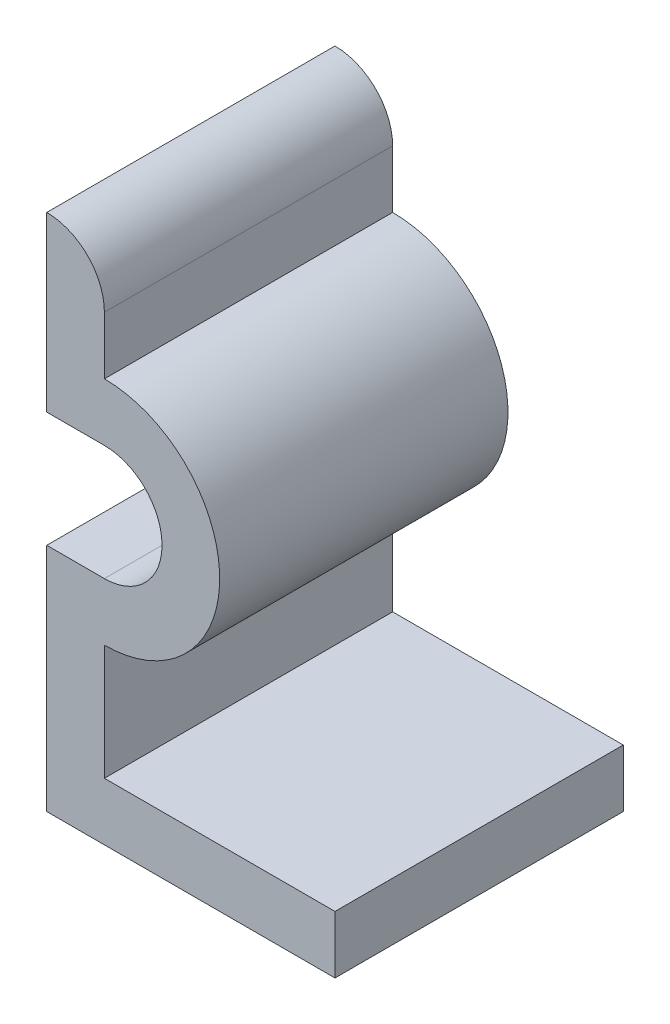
from build123d import *

# Parameters (mm, degrees)
EXTRUDE1_DEPTH = 12.5


with BuildPart() as part:
    # Sketch1 → Extrude1 (new, symmetric)
    with BuildSketch(Plane.XY):
        with BuildLine():
            Line((0, 0), (25, 0))
            Line((25, 0), (25, 5))
            Line((25, 5), (5, 5))
            Line((5, 5), (5, 15))
            ThreePointArc((5, 15), (15, 25), (5, 35))
            Line((5, 35), (5, 40))
            ThreePointArc((5, 40), (3.535533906, 43.535533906), (0, 45))
            Line((0, 45), (0, 30))
            Line((0, 30), (5, 30))
            ThreePointArc((5, 30), (10, 25), (5, 20))
            Line((5, 20), (0, 20))
            Line((0, 20), (0, 0))
        make_face()
    extrude(amount=EXTRUDE1_DEPTH, both=True)


solid = part.part
